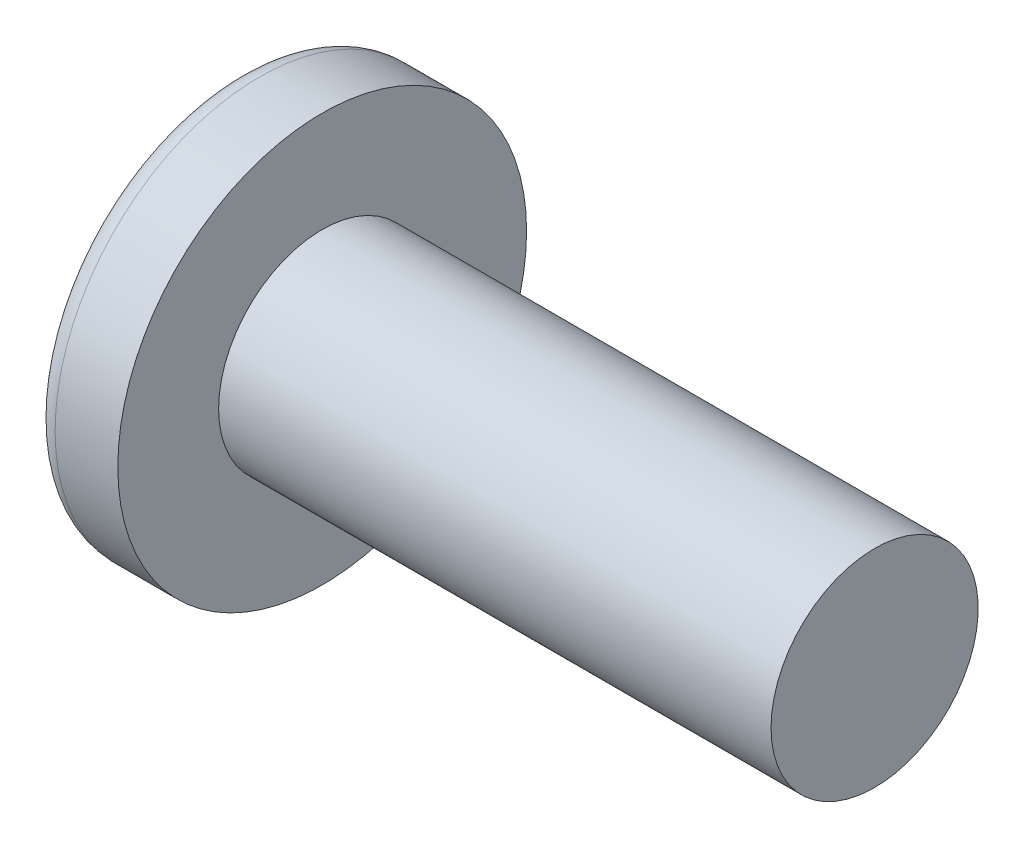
from build123d import *

# Parameters (mm, degrees)
CIRPATTERN1_COUNT = 2
CIRPATTERN1_ANGLE = 90


with BuildPart() as part:
    # BodySke → Base-Revolve (revolve)
    with BuildSketch(Plane.XY, mode=Mode.PRIVATE) as base_revolve_sk:
        with BuildLine():
            Line((6.6294, 4.7625), (6.6294, 9.398))
            Line((6.6294, 9.398), (3.748078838, 9.398))
            ThreePointArc((3.748078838, 9.398), (3.287664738, 9.287690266), (2.927227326, 8.980714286))
            ThreePointArc((2.927227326, 8.980714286), (0.750275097, 4.72286695), (0, 0))
            Line((0, 0), (32.0294, 0))
            Line((32.0294, 0), (32.0294, 4.7625))
            Line((32.0294, 4.7625), (6.6294, 4.7625))
        make_face()
    revolve(base_revolve_sk.sketch.rotate(Axis((-25.4, 0, 0), (1, 0, 0)), 90), axis=Axis((-25.4, 0, 0), (1, 0, 0)))

    # Sketch3 → Cut-Loft1 section 0
    with BuildSketch(Plane(origin=(0, 0, 0), x_dir=(0, 0, -1), z_dir=(1, 0, 0))):
        with BuildLine():
            Line((1.0287, -6.096), (-1.0287, -6.096))
            Line((-1.0287, -6.096), (-1.0287, 6.096))
            Line((-1.0287, 6.096), (1.0287, 6.096))
            Line((1.0287, 6.096), (1.0287, -6.096))
        make_face()
    # Sketch4 → Cut-Loft1 section 1
    with BuildSketch(Plane(origin=(7.2644, 0, 0), x_dir=(0, 0, -1), z_dir=(1, 0, 0))):
        with BuildLine():
            Line((0.51435, -0.51435), (-0.51435, -0.51435))
            Line((-0.51435, -0.51435), (-0.51435, 0.51435))
            Line((-0.51435, 0.51435), (0.51435, 0.51435))
            Line((0.51435, 0.51435), (0.51435, -0.51435))
        make_face()
    cut_loft1 = loft(mode=Mode.SUBTRACT)

    # CirPattern1: Cut-Loft1 ×2 about axis
    cirpattern1_axis = Axis((0, 0, 0), (1, 0, 0))
    for i in range(1, CIRPATTERN1_COUNT):
        add(cut_loft1.rotate(cirpattern1_axis, i * CIRPATTERN1_ANGLE / (CIRPATTERN1_COUNT - 1)), mode=Mode.SUBTRACT)


solid = part.part
